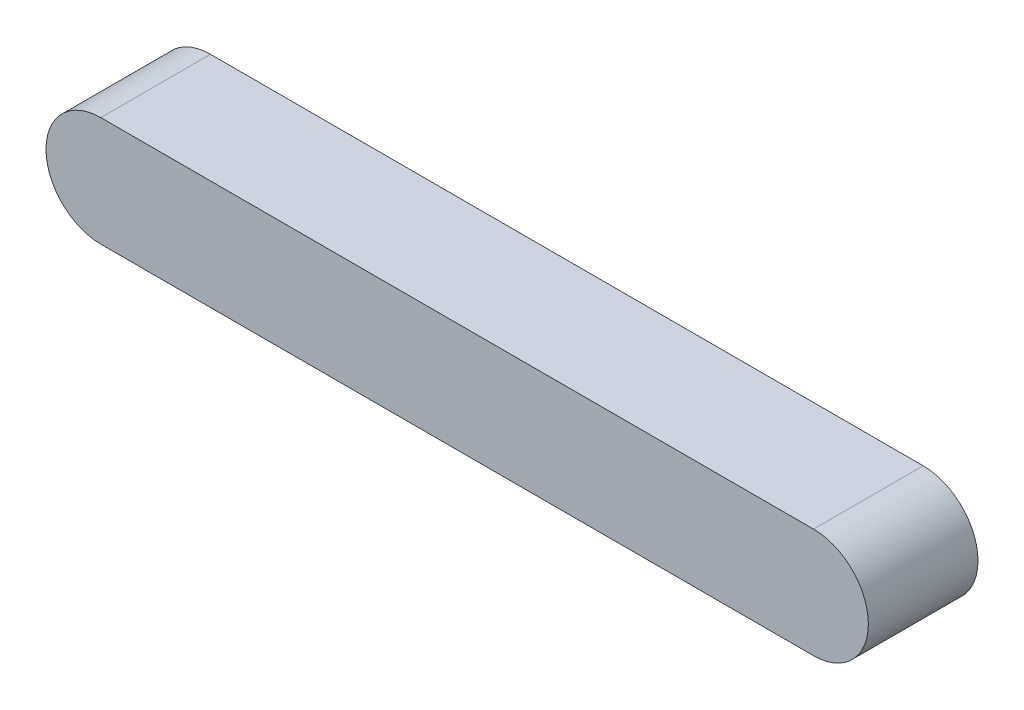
from build123d import *

# Parameters (mm, degrees)
LINEAR_AUSTRAGEN1_DEPTH = 6


with BuildPart() as part:
    # Skizze1 → Linear austragen1 (new body)
    with BuildSketch(Plane.XY):
        with BuildLine():
            Line((-19.5, -3), (19.5, -3))
            ThreePointArc((19.5, -3), (22.5, 0), (19.5, 3))
            Line((19.5, 3), (-19.5, 3))
            ThreePointArc((-19.5, 3), (-22.5, 0), (-19.5, -3))
        make_face()
    extrude(amount=LINEAR_AUSTRAGEN1_DEPTH)


solid = part.part
